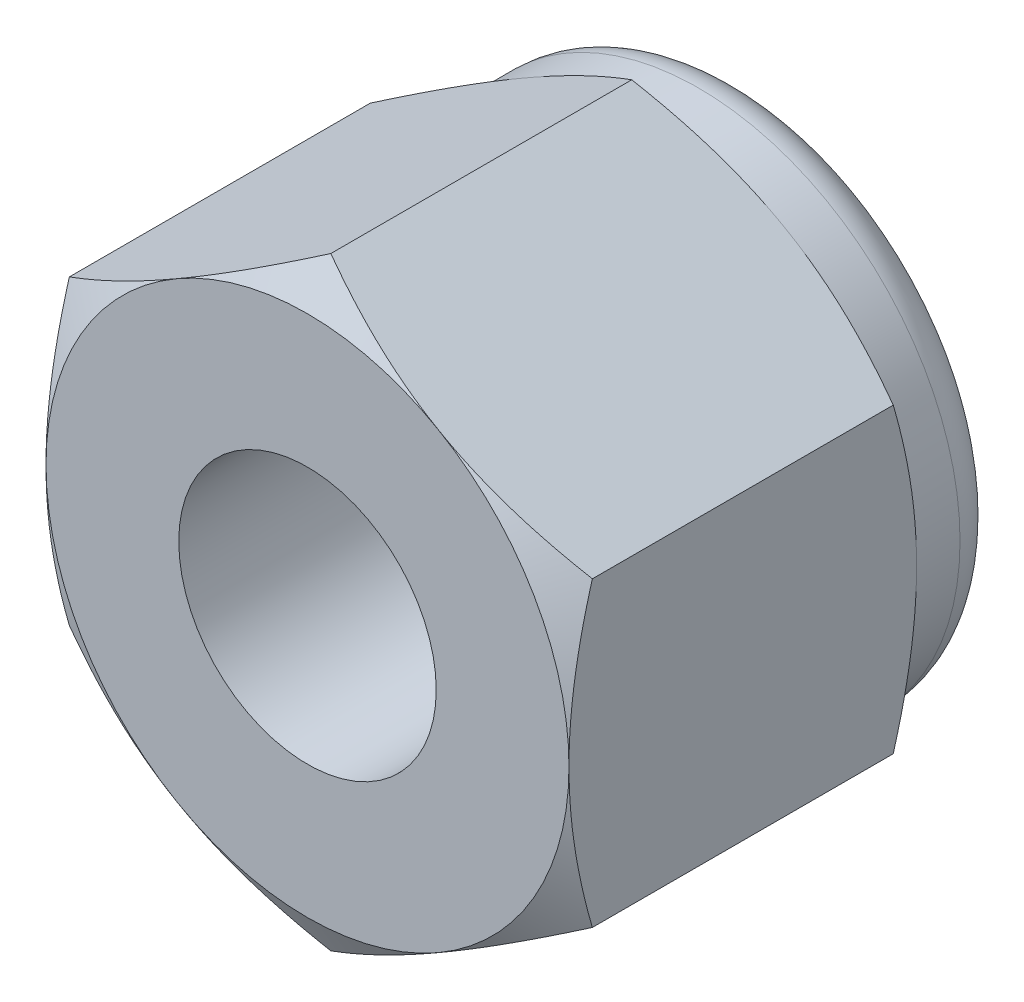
from build123d import *

# Parameters (mm, degrees)
BASE_EXTRUSION_DEPTH    = 8.64
ESQUISSE3_R             = 4
ENL_V_MAT_EXTRU_1_DEPTH = 14.161798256
ESQUISSE5_R             = 4
ESQUISSE5_R_2           = 3.2
BOSS_EXTRU_1_DEPTH      = 8.64


with BuildPart() as part:
    # Esquisse1 → Base-Extrusion (new body)
    with BuildSketch(Plane.XY):
        Polygon((6.5, -3.75277675), (6.5, 3.75277675), (0, 7.505553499), (-6.5, 3.75277675), (-6.5, -3.75277675), (0, -7.505553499), align=None)
    extrude(amount=-BASE_EXTRUSION_DEPTH)

    # Esquisse2 → Enl_vement de mati_re-R_volution1 (revolve, cut)
    with BuildSketch(Plane(origin=(0, 0, 0), x_dir=(1, 0, 0), z_dir=(0, 1, 0))):
        Polygon((-6.5, 0), (-14.982459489, 0), (-14.982459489, 8.64), (-6.5, 8.64), (-13.982459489, 4.32), align=None)
    revolve(axis=Axis((0, 0, -8.64), (0, 0, 1)), mode=Mode.SUBTRACT)

    # Esquisse3 → Enl_v. mat.-Extru.1 (cut, through all)
    with BuildSketch(Plane.XY):
        Circle(ESQUISSE3_R)
    extrude(amount=-ENL_V_MAT_EXTRU_1_DEPTH, mode=Mode.SUBTRACT)

    # Esquisse4 → Boss.-R_vol.1 (revolve)
    with BuildSketch(Plane(origin=(0, 0, 0), x_dir=(0, 0, -1), z_dir=(1, 0, 0)), mode=Mode.PRIVATE) as boss_r_vol_1_sk:
        with BuildLine():
            Line((8.64, 6.5), (9.72, 6.5))
            ThreePointArc((9.72, 6.5), (10.483675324, 6.183675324), (10.8, 5.42))
            Line((10.8, 5.42), (10.8, 5.126388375))
            Line((10.8, 5.126388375), (9.9, 5.126388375))
            Line((9.9, 5.126388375), (9.9, 3.75277675))
            Line((9.9, 3.75277675), (8.64, 3.75277675))
            Line((8.64, 3.75277675), (8.64, 6.5))
        make_face()
    revolve(boss_r_vol_1_sk.sketch.rotate(Axis((0, 0, 0), (0, 0, -1)), 90), axis=Axis((0, 0, 0), (0, 0, -1)))

    # Esquisse5 → Boss.-Extru.1 (add)
    with BuildSketch(Plane.XY):
        Circle(ESQUISSE5_R)
        Circle(ESQUISSE5_R_2, mode=Mode.SUBTRACT)
    extrude(amount=-BOSS_EXTRU_1_DEPTH)


solid = part.part
